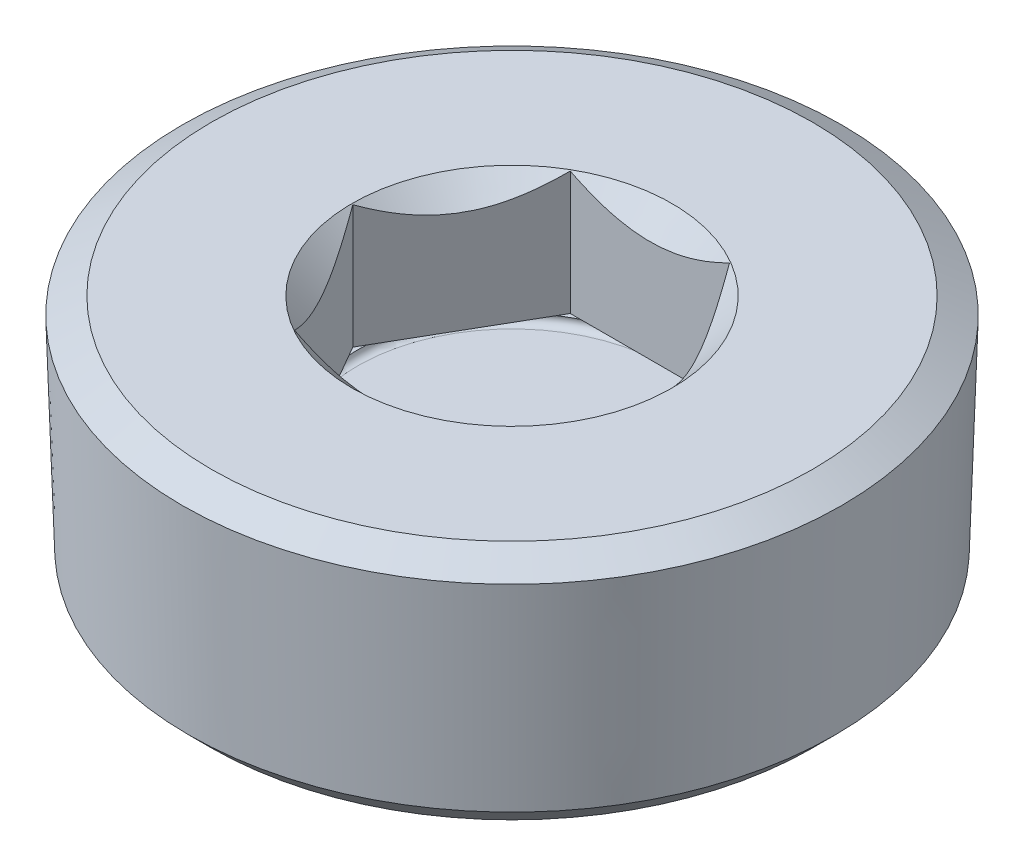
ISO-10303-21;
HEADER;
FILE_DESCRIPTION(('STEP AP214'),'2;1');
FILE_NAME('part.step','',(''),(''),'','','');
FILE_SCHEMA(('AUTOMOTIVE_DESIGN { 1 0 10303 214 1 1 1 1 }'));
ENDSEC;
DATA;
#1=APPLICATION_CONTEXT('core data for automotive mechanical design processes');
#2=APPLICATION_PROTOCOL_DEFINITION('international standard','automotive_design',2000,#1);
#3=PRODUCT_CONTEXT('',#1,'mechanical');
#4=PRODUCT('Part','Part','',(#3));
#5=PRODUCT_RELATED_PRODUCT_CATEGORY('part','',(#4));
#6=PRODUCT_DEFINITION_FORMATION('','',#4);
#7=PRODUCT_DEFINITION_CONTEXT('part definition',#1,'design');
#8=PRODUCT_DEFINITION('design','',#6,#7);
#9=PRODUCT_DEFINITION_SHAPE('','',#8);
#10=(LENGTH_UNIT() NAMED_UNIT(*) SI_UNIT(.MILLI.,.METRE.));
#11=(NAMED_UNIT(*) PLANE_ANGLE_UNIT() SI_UNIT($,.RADIAN.));
#12=(NAMED_UNIT(*) SI_UNIT($,.STERADIAN.) SOLID_ANGLE_UNIT());
#13=UNCERTAINTY_MEASURE_WITH_UNIT(LENGTH_MEASURE(1.E-05),#10,'distance_accuracy_value','');
#14=(GEOMETRIC_REPRESENTATION_CONTEXT(3) GLOBAL_UNCERTAINTY_ASSIGNED_CONTEXT((#13)) GLOBAL_UNIT_ASSIGNED_CONTEXT((#10,
#11,#12)) REPRESENTATION_CONTEXT('',''));
#15=CARTESIAN_POINT('',(0.,0.,0.));
#16=DIRECTION('',(0.,0.,1.));
#17=DIRECTION('',(1.,0.,0.));
#18=AXIS2_PLACEMENT_3D('',#15,#16,#17);
#19=CARTESIAN_POINT('',(0.,0.,0.));
#20=DIRECTION('',(0.,1.,0.));
#21=DIRECTION('',(0.,0.,1.));
#22=AXIS2_PLACEMENT_3D('',#19,#20,#21);
#23=PLANE('',#22);
#24=CARTESIAN_POINT('',(0.,0.,0.));
#25=DIRECTION('',(0.,1.,0.));
#26=DIRECTION('',(0.,0.,1.));
#27=AXIS2_PLACEMENT_3D('',#24,#25,#26);
#28=CIRCLE('',#27,14.732);
#29=CARTESIAN_POINT('',(0.,0.,14.732));
#30=VERTEX_POINT('',#29);
#31=EDGE_CURVE('E177',#30,#30,#28,.T.);
#32=ORIENTED_EDGE('',*,*,#31,.F.);
#33=EDGE_LOOP('',(#32));
#34=FACE_BOUND('',#33,.T.);
#35=CARTESIAN_POINT('',(0.,0.,0.));
#36=DIRECTION('',(0.,1.,0.));
#37=DIRECTION('',(0.,0.,1.));
#38=AXIS2_PLACEMENT_3D('',#35,#36,#37);
#39=CIRCLE('',#38,27.6907105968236);
#40=CARTESIAN_POINT('',(0.,0.,27.6907105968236));
#41=VERTEX_POINT('',#40);
#42=EDGE_CURVE('E12',#41,#41,#39,.T.);
#43=ORIENTED_EDGE('',*,*,#42,.T.);
#44=EDGE_LOOP('',(#43));
#45=FACE_BOUND('',#44,.T.);
#46=ADVANCED_FACE('F33',(#34,#45),#23,.T.);
#47=CARTESIAN_POINT('',(0.,0.,0.));
#48=DIRECTION('',(0.,-1.,0.));
#49=DIRECTION('',(0.,0.,-1.));
#50=AXIS2_PLACEMENT_3D('',#47,#48,#49);
#51=CONICAL_SURFACE('',#50,27.6907105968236,1.0471975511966);
#52=CARTESIAN_POINT('',(0.,-1.54587407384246,0.));
#53=DIRECTION('',(0.,1.,0.));
#54=DIRECTION('',(0.,0.,1.));
#55=AXIS2_PLACEMENT_3D('',#52,#53,#54);
#56=CIRCLE('',#55,30.3682430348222);
#57=CARTESIAN_POINT('',(0.,-1.54587407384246,30.3682430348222));
#58=VERTEX_POINT('',#57);
#59=EDGE_CURVE('E40',#58,#58,#56,.T.);
#60=ORIENTED_EDGE('',*,*,#59,.T.);
#61=EDGE_LOOP('',(#60));
#62=FACE_BOUND('',#61,.T.);
#63=ORIENTED_EDGE('',*,*,#42,.F.);
#64=EDGE_LOOP('',(#63));
#65=FACE_BOUND('',#64,.T.);
#66=ADVANCED_FACE('F191',(#62,#65),#51,.T.);
#67=CARTESIAN_POINT('',(0.,-1.54587407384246,0.));
#68=DIRECTION('',(0.,1.,0.));
#69=DIRECTION('',(0.,0.,1.));
#70=AXIS2_PLACEMENT_3D('',#67,#68,#69);
#71=CONICAL_SURFACE('',#70,30.3682430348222,0.0312064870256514);
#72=CARTESIAN_POINT('',(0.,-20.1275238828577,0.));
#73=DIRECTION('',(0.,1.,0.));
#74=DIRECTION('',(0.,0.,1.));
#75=AXIS2_PLACEMENT_3D('',#72,#73,#74);
#76=CIRCLE('',#75,29.7881867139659);
#77=CARTESIAN_POINT('',(0.,-20.1275238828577,29.7881867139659));
#78=VERTEX_POINT('',#77);
#79=EDGE_CURVE('E186',#78,#78,#76,.T.);
#80=ORIENTED_EDGE('',*,*,#79,.T.);
#81=EDGE_LOOP('',(#80));
#82=FACE_BOUND('',#81,.T.);
#83=ORIENTED_EDGE('',*,*,#59,.F.);
#84=EDGE_LOOP('',(#83));
#85=FACE_BOUND('',#84,.T.);
#86=ADVANCED_FACE('F194',(#82,#85),#71,.T.);
#87=CARTESIAN_POINT('',(0.,-20.1275238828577,0.));
#88=DIRECTION('',(0.,1.,0.));
#89=DIRECTION('',(0.,0.,1.));
#90=AXIS2_PLACEMENT_3D('',#87,#88,#89);
#91=CONICAL_SURFACE('',#90,29.7881867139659,0.785398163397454);
#92=CARTESIAN_POINT('',(0.,-22.225,0.));
#93=DIRECTION('',(0.,1.,0.));
#94=DIRECTION('',(0.,0.,1.));
#95=AXIS2_PLACEMENT_3D('',#92,#93,#94);
#96=CIRCLE('',#95,27.6907105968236);
#97=CARTESIAN_POINT('',(0.,-22.225,27.6907105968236));
#98=VERTEX_POINT('',#97);
#99=EDGE_CURVE('E183',#98,#98,#96,.T.);
#100=ORIENTED_EDGE('',*,*,#99,.T.);
#101=EDGE_LOOP('',(#100));
#102=FACE_BOUND('',#101,.T.);
#103=ORIENTED_EDGE('',*,*,#79,.F.);
#104=EDGE_LOOP('',(#103));
#105=FACE_BOUND('',#104,.T.);
#106=ADVANCED_FACE('F196',(#102,#105),#91,.T.);
#107=CARTESIAN_POINT('',(-27.6907105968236,-22.225,0.));
#108=DIRECTION('',(0.,-1.,0.));
#109=DIRECTION('',(0.,0.,-1.));
#110=AXIS2_PLACEMENT_3D('',#107,#108,#109);
#111=PLANE('',#110);
#112=ORIENTED_EDGE('',*,*,#99,.F.);
#113=EDGE_LOOP('',(#112));
#114=FACE_BOUND('',#113,.T.);
#115=ADVANCED_FACE('F203',(#114),#111,.T.);
#116=CARTESIAN_POINT('',(0.,0.,0.));
#117=DIRECTION('',(0.,1.,0.));
#118=DIRECTION('',(0.,0.,1.));
#119=AXIS2_PLACEMENT_3D('',#116,#117,#118);
#120=CONICAL_SURFACE('',#119,14.732,0.785398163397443);
#121=CARTESIAN_POINT('',(-15.3291894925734,5.17463332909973,12.7));
#122=CARTESIAN_POINT('',(-14.9589479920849,4.88959123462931,12.7));
#123=CARTESIAN_POINT('',(-14.5867146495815,4.60709574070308,12.7));
#124=CARTESIAN_POINT('',(-13.8374490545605,4.04836230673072,12.7));
#125=CARTESIAN_POINT('',(-13.4604156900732,3.77212585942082,12.7));
#126=CARTESIAN_POINT('',(-12.6979798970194,3.22510913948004,12.7));
#127=CARTESIAN_POINT('',(-12.3125353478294,2.95438738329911,12.7));
#128=CARTESIAN_POINT('',(-11.5352366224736,2.42233918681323,12.7));
#129=CARTESIAN_POINT('',(-11.1433828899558,2.16101210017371,12.7));
#130=CARTESIAN_POINT('',(-10.3270006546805,1.63362575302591,12.7));
#131=CARTESIAN_POINT('',(-9.90198012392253,1.36832433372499,12.7));
#132=CARTESIAN_POINT('',(-9.0419558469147,0.854150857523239,12.7));
#133=CARTESIAN_POINT('',(-8.60695043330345,0.605281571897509,12.7));
#134=CARTESIAN_POINT('',(-7.72683347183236,0.129269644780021,12.7));
#135=CARTESIAN_POINT('',(-7.28175668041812,-0.0979367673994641,12.7));
#136=CARTESIAN_POINT('',(-6.3789973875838,-0.525532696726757,12.7));
#137=CARTESIAN_POINT('',(-5.92132096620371,-0.725934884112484,12.7));
#138=CARTESIAN_POINT('',(-5.03853629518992,-1.07443088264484,12.7));
#139=CARTESIAN_POINT('',(-4.61470922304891,-1.22574334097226,12.7));
#140=CARTESIAN_POINT('',(-3.75615169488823,-1.49444779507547,12.7));
#141=CARTESIAN_POINT('',(-3.32142054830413,-1.6118376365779,12.7));
#142=CARTESIAN_POINT('',(-2.66688443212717,-1.75671421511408,12.7));
#143=CARTESIAN_POINT('',(-2.45041353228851,-1.79953502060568,12.7));
#144=CARTESIAN_POINT('',(-2.01568738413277,-1.87481478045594,12.7));
#145=CARTESIAN_POINT('',(-1.79743238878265,-1.90727517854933,12.7));
#146=CARTESIAN_POINT('',(-1.35959203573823,-1.96127985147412,12.7));
#147=CARTESIAN_POINT('',(-1.14000679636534,-1.98282508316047,12.7));
#148=CARTESIAN_POINT('',(-0.700016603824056,-2.0146147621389,12.7));
#149=CARTESIAN_POINT('',(-0.479611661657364,-2.02485936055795,12.7));
#150=CARTESIAN_POINT('',(-0.048288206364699,-2.03365728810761,12.7));
#151=CARTESIAN_POINT('',(0.162620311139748,-2.0327059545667,12.7));
#152=CARTESIAN_POINT('',(0.584151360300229,-2.02031870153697,12.7));
#153=CARTESIAN_POINT('',(0.794773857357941,-2.00888161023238,12.7));
#154=CARTESIAN_POINT('',(1.21519356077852,-1.97571555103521,12.7));
#155=CARTESIAN_POINT('',(1.42499081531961,-1.95398719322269,12.7));
#156=CARTESIAN_POINT('',(1.84332802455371,-1.90060227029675,12.7));
#157=CARTESIAN_POINT('',(2.05186780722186,-1.86894437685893,12.7));
#158=CARTESIAN_POINT('',(2.68244777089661,-1.75846982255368,12.7));
#159=CARTESIAN_POINT('',(3.10194616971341,-1.66476681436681,12.7));
#160=CARTESIAN_POINT('',(3.93162363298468,-1.44337797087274,12.7));
#161=CARTESIAN_POINT('',(4.34180321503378,-1.31569402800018,12.7));
#162=CARTESIAN_POINT('',(5.17500836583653,-1.02397670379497,12.7));
#163=CARTESIAN_POINT('',(5.59745269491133,-0.858298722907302,12.7));
#164=CARTESIAN_POINT('',(6.43147266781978,-0.501341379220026,12.7));
#165=CARTESIAN_POINT('',(6.84304331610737,-0.310050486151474,12.7));
#166=CARTESIAN_POINT('',(7.65726509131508,0.0935964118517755,12.7));
#167=CARTESIAN_POINT('',(8.05988381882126,0.306017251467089,12.7));
#168=CARTESIAN_POINT('',(8.85589628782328,0.747250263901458,12.7));
#169=CARTESIAN_POINT('',(9.24929143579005,0.976059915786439,12.7));
#170=CARTESIAN_POINT('',(10.008839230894,1.43524962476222,12.7));
#171=CARTESIAN_POINT('',(10.37537796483,1.66499441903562,12.7));
#172=CARTESIAN_POINT('',(11.1021578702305,2.13426677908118,12.7));
#173=CARTESIAN_POINT('',(11.4623985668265,2.37379507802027,12.7));
#174=CARTESIAN_POINT('',(12.1745109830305,2.85894094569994,12.7));
#175=CARTESIAN_POINT('',(12.5264266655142,3.10449421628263,12.7));
#176=CARTESIAN_POINT('',(13.2254296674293,3.60218595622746,12.7));
#177=CARTESIAN_POINT('',(13.5725182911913,3.85432259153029,12.7));
#178=CARTESIAN_POINT('',(13.917581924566,4.10915406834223,12.7));
#179=B_SPLINE_CURVE_WITH_KNOTS('',3,(#121,#122,#123,#124,#125,#126,#127,#128,#129,#130,#131,
#132,#133,#134,#135,#136,#137,#138,#139,#140,#141,#142,#143,#144,#145,#146,#147,#148,#149,#150,
#151,#152,#153,#154,#155,#156,#157,#158,#159,#160,#161,#162,#163,#164,#165,#166,#167,#168,#169,
#170,#171,#172,#173,#174,#175,#176,#177,#178),.UNSPECIFIED.,.F.,.F.,(4,2,2,2,2,2,2,2,2,2,2,2,2,
2,2,2,2,2,2,2,2,2,2,2,2,2,2,2,4),(0.,1.40179234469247,2.80391556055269,4.21685329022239,
5.62969362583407,7.13247727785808,8.63551372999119,10.1339793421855,11.6317341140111,
12.9807032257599,14.3297579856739,14.991546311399,15.6532423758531,16.3148804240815,
16.9765096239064,17.608980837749,18.2415227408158,18.8740271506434,19.5066162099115,
20.7942875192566,22.0818871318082,23.4421454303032,24.8030181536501,26.168203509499,
27.5331793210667,28.8307644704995,30.128447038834,31.4157149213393,32.7026279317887),.UNSPECIFIED.);
#180=CARTESIAN_POINT('',(7.33234841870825,-0.0673031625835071,12.7));
#181=VERTEX_POINT('',#180);
#182=CARTESIAN_POINT('',(-7.33234841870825,-0.0673031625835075,12.7));
#183=VERTEX_POINT('',#182);
#184=EDGE_CURVE('E47',#181,#183,#179,.F.);
#185=ORIENTED_EDGE('',*,*,#184,.T.);
#186=CARTESIAN_POINT('',(-7.33223294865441,-0.0671876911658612,12.7002));
#187=CARTESIAN_POINT('',(-7.45829190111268,-0.193227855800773,12.4818594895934));
#188=CARTESIAN_POINT('',(-7.58533809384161,-0.315421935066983,12.2618090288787));
#189=CARTESIAN_POINT('',(-7.84155862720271,-0.550896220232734,11.8180220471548));
#190=CARTESIAN_POINT('',(-7.97073408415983,-0.66417155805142,11.5942835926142));
#191=CARTESIAN_POINT('',(-8.23197607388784,-0.881066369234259,11.1417991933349));
#192=CARTESIAN_POINT('',(-8.364054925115,-0.984626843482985,10.9130319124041));
#193=CARTESIAN_POINT('',(-8.63038195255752,-1.17984271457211,10.4517399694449));
#194=CARTESIAN_POINT('',(-8.76462979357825,-1.27149993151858,10.2192158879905));
#195=CARTESIAN_POINT('',(-9.03313634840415,-1.44000927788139,9.75414889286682));
#196=CARTESIAN_POINT('',(-9.16736206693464,-1.51707050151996,9.52166312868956));
#197=CARTESIAN_POINT('',(-9.43769508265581,-1.65658272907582,9.05343261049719));
#198=CARTESIAN_POINT('',(-9.57380217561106,-1.71903530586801,8.81768821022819));
#199=CARTESIAN_POINT('',(-9.84731577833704,-1.82775795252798,8.34394875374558));
#200=CARTESIAN_POINT('',(-9.98471863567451,-1.874064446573,8.10596002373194));
#201=CARTESIAN_POINT('',(-10.2606778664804,-1.94947741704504,7.62798461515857));
#202=CARTESIAN_POINT('',(-10.3992340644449,-1.97858646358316,7.38799824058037));
#203=CARTESIAN_POINT('',(-10.7368852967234,-2.02739428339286,6.80316915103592));
#204=CARTESIAN_POINT('',(-10.9363452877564,-2.03763638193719,6.45769431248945));
#205=CARTESIAN_POINT('',(-11.3349045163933,-2.02044398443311,5.7673694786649));
#206=CARTESIAN_POINT('',(-11.5340036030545,-1.99299628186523,5.4225197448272));
#207=CARTESIAN_POINT('',(-11.9303249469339,-1.90204439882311,4.7360710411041));
#208=CARTESIAN_POINT('',(-12.1275448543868,-1.83849990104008,4.39447614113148));
#209=CARTESIAN_POINT('',(-12.5185948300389,-1.67880849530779,3.7171577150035));
#210=CARTESIAN_POINT('',(-12.7124251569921,-1.58266408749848,3.38143374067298));
#211=CARTESIAN_POINT('',(-13.0564965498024,-1.38487297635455,2.78548460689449));
#212=CARTESIAN_POINT('',(-13.207499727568,-1.28842963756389,2.52393943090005));
#213=CARTESIAN_POINT('',(-13.5067956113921,-1.08000258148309,2.00554375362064));
#214=CARTESIAN_POINT('',(-13.6550882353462,-0.968018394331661,1.74869339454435));
#215=CARTESIAN_POINT('',(-13.9484959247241,-0.731019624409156,1.24049636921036));
#216=CARTESIAN_POINT('',(-14.0936193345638,-0.606046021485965,0.989135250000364));
#217=CARTESIAN_POINT('',(-14.3811790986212,-0.34470890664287,0.491067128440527));
#218=CARTESIAN_POINT('',(-14.5236170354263,-0.208352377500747,0.2443573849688));
#219=CARTESIAN_POINT('',(-14.6648123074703,-0.0671876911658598,-0.00019999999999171));
#220=B_SPLINE_CURVE_WITH_KNOTS('',3,(#186,#187,#188,#189,#190,#191,#192,#193,#194,#195,#196,
#197,#198,#199,#200,#201,#202,#203,#204,#205,#206,#207,#208,#209,#210,#211,#212,#213,#214,#215,
#216,#217,#218,#219),.UNSPECIFIED.,.F.,.F.,(4,2,2,2,2,2,2,2,2,2,2,2,2,2,2,2,4),(0.,
0.845639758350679,1.69173793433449,2.54268053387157,3.39349286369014,4.23100113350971,
5.06841918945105,5.90393569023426,6.73932729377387,7.9346157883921,9.13032321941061,
10.3273687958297,11.5243225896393,12.4749718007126,13.4256497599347,14.3734146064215,
15.3206022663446),.UNSPECIFIED.);
#221=CARTESIAN_POINT('',(-14.6646968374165,-0.0673031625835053,0.));
#222=VERTEX_POINT('',#221);
#223=EDGE_CURVE('E140',#183,#222,#220,.T.);
#224=ORIENTED_EDGE('',*,*,#223,.T.);
#225=CARTESIAN_POINT('',(-14.6648123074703,-0.0671876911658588,0.00020000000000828));
#226=CARTESIAN_POINT('',(-14.5387533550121,-0.193227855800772,-0.218140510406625));
#227=CARTESIAN_POINT('',(-14.4117071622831,-0.315421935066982,-0.438190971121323));
#228=CARTESIAN_POINT('',(-14.155486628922,-0.550896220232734,-0.881977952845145));
#229=CARTESIAN_POINT('',(-14.0263111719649,-0.66417155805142,-1.10571640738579));
#230=CARTESIAN_POINT('',(-13.7650691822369,-0.881066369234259,-1.5582008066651));
#231=CARTESIAN_POINT('',(-13.6329903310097,-0.984626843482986,-1.78696808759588));
#232=CARTESIAN_POINT('',(-13.3666633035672,-1.17984271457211,-2.24826003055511));
#233=CARTESIAN_POINT('',(-13.2324154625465,-1.27149993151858,-2.48078411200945));
#234=CARTESIAN_POINT('',(-12.9639089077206,-1.44000927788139,-2.94585110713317));
#235=CARTESIAN_POINT('',(-12.8296831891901,-1.51707050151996,-3.17833687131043));
#236=CARTESIAN_POINT('',(-12.5593501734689,-1.65658272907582,-3.64656738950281));
#237=CARTESIAN_POINT('',(-12.4232430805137,-1.71903530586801,-3.8823117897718));
#238=CARTESIAN_POINT('',(-12.1497294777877,-1.82775795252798,-4.35605124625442));
#239=CARTESIAN_POINT('',(-12.0123266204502,-1.87406444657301,-4.59403997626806));
#240=CARTESIAN_POINT('',(-11.7363673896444,-1.94947741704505,-5.07201538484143));
#241=CARTESIAN_POINT('',(-11.5978111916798,-1.97858646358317,-5.31200175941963));
#242=CARTESIAN_POINT('',(-11.2601599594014,-2.02739428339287,-5.89683084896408));
#243=CARTESIAN_POINT('',(-11.0606999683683,-2.03763638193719,-6.24230568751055));
#244=CARTESIAN_POINT('',(-10.6621407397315,-2.02044398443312,-6.9326305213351));
#245=CARTESIAN_POINT('',(-10.4630416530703,-1.99299628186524,-7.2774802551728));
#246=CARTESIAN_POINT('',(-10.0667203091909,-1.90204439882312,-7.9639289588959));
#247=CARTESIAN_POINT('',(-9.86950040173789,-1.83849990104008,-8.30552385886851));
#248=CARTESIAN_POINT('',(-9.47845042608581,-1.67880849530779,-8.9828422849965));
#249=CARTESIAN_POINT('',(-9.28462009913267,-1.58266408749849,-9.31856625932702));
#250=CARTESIAN_POINT('',(-8.94054870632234,-1.38487297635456,-9.91451539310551));
#251=CARTESIAN_POINT('',(-8.7895455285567,-1.2884296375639,-10.1760605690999));
#252=CARTESIAN_POINT('',(-8.49024964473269,-1.0800025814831,-10.6944562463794));
#253=CARTESIAN_POINT('',(-8.34195702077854,-0.968018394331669,-10.9513066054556));
#254=CARTESIAN_POINT('',(-8.0485493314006,-0.731019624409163,-11.4595036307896));
#255=CARTESIAN_POINT('',(-7.9034259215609,-0.606046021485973,-11.7108647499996));
#256=CARTESIAN_POINT('',(-7.61586615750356,-0.344708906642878,-12.2089328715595));
#257=CARTESIAN_POINT('',(-7.47342822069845,-0.208352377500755,-12.4556426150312));
#258=CARTESIAN_POINT('',(-7.33223294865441,-0.0671876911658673,-12.7002));
#259=B_SPLINE_CURVE_WITH_KNOTS('',3,(#225,#226,#227,#228,#229,#230,#231,#232,#233,#234,#235,
#236,#237,#238,#239,#240,#241,#242,#243,#244,#245,#246,#247,#248,#249,#250,#251,#252,#253,#254,
#255,#256,#257,#258),.UNSPECIFIED.,.F.,.F.,(4,2,2,2,2,2,2,2,2,2,2,2,2,2,2,2,4),(0.,
0.84563975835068,1.6917379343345,2.54268053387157,3.39349286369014,4.23100113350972,
5.06841918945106,5.90393569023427,6.73932729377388,7.93461578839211,9.13032321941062,
10.3273687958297,11.5243225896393,12.4749718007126,13.4256497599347,14.3734146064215,
15.3206022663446),.UNSPECIFIED.);
#260=CARTESIAN_POINT('',(-7.33234841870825,-0.0673031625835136,-12.7));
#261=VERTEX_POINT('',#260);
#262=EDGE_CURVE('E262',#222,#261,#259,.T.);
#263=ORIENTED_EDGE('',*,*,#262,.T.);
#264=CARTESIAN_POINT('',(-15.3291894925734,5.17463332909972,-12.7));
#265=CARTESIAN_POINT('',(-14.9589479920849,4.8895912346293,-12.7));
#266=CARTESIAN_POINT('',(-14.5867146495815,4.60709574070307,-12.7));
#267=CARTESIAN_POINT('',(-13.8374490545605,4.04836230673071,-12.7));
#268=CARTESIAN_POINT('',(-13.4604156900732,3.77212585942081,-12.7));
#269=CARTESIAN_POINT('',(-12.6979798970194,3.22510913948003,-12.7));
#270=CARTESIAN_POINT('',(-12.3125353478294,2.95438738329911,-12.7));
#271=CARTESIAN_POINT('',(-11.5352366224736,2.42233918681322,-12.7));
#272=CARTESIAN_POINT('',(-11.1433828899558,2.1610121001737,-12.7));
#273=CARTESIAN_POINT('',(-10.3270006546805,1.6336257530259,-12.7));
#274=CARTESIAN_POINT('',(-9.90198012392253,1.36832433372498,-12.7));
#275=CARTESIAN_POINT('',(-9.0419558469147,0.854150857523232,-12.7));
#276=CARTESIAN_POINT('',(-8.60695043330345,0.6052815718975,-12.7));
#277=CARTESIAN_POINT('',(-7.72683347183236,0.129269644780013,-12.7));
#278=CARTESIAN_POINT('',(-7.28175668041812,-0.0979367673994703,-12.7));
#279=CARTESIAN_POINT('',(-6.3789973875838,-0.525532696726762,-12.7));
#280=CARTESIAN_POINT('',(-5.92132096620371,-0.725934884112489,-12.7));
#281=CARTESIAN_POINT('',(-5.03853629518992,-1.07443088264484,-12.7));
#282=CARTESIAN_POINT('',(-4.61470922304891,-1.22574334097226,-12.7));
#283=CARTESIAN_POINT('',(-3.75615169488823,-1.49444779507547,-12.7));
#284=CARTESIAN_POINT('',(-3.32142054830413,-1.6118376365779,-12.7));
#285=CARTESIAN_POINT('',(-2.66688443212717,-1.75671421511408,-12.7));
#286=CARTESIAN_POINT('',(-2.45041353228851,-1.79953502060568,-12.7));
#287=CARTESIAN_POINT('',(-2.01568738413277,-1.87481478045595,-12.7));
#288=CARTESIAN_POINT('',(-1.79743238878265,-1.90727517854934,-12.7));
#289=CARTESIAN_POINT('',(-1.35959203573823,-1.96127985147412,-12.7));
#290=CARTESIAN_POINT('',(-1.14000679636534,-1.98282508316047,-12.7));
#291=CARTESIAN_POINT('',(-0.70001660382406,-2.01461476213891,-12.7));
#292=CARTESIAN_POINT('',(-0.479611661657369,-2.02485936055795,-12.7));
#293=CARTESIAN_POINT('',(-0.0482882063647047,-2.03365728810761,-12.7));
#294=CARTESIAN_POINT('',(0.162620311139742,-2.03270595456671,-12.7));
#295=CARTESIAN_POINT('',(0.584151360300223,-2.02031870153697,-12.7));
#296=CARTESIAN_POINT('',(0.794773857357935,-2.00888161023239,-12.7));
#297=CARTESIAN_POINT('',(1.21519356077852,-1.97571555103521,-12.7));
#298=CARTESIAN_POINT('',(1.4249908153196,-1.95398719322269,-12.7));
#299=CARTESIAN_POINT('',(1.8433280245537,-1.90060227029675,-12.7));
#300=CARTESIAN_POINT('',(2.05186780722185,-1.86894437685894,-12.7));
#301=CARTESIAN_POINT('',(2.6824477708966,-1.75846982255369,-12.7));
#302=CARTESIAN_POINT('',(3.1019461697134,-1.66476681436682,-12.7));
#303=CARTESIAN_POINT('',(3.93162363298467,-1.44337797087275,-12.7));
#304=CARTESIAN_POINT('',(4.34180321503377,-1.31569402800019,-12.7));
#305=CARTESIAN_POINT('',(5.17500836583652,-1.02397670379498,-12.7));
#306=CARTESIAN_POINT('',(5.59745269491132,-0.858298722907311,-12.7));
#307=CARTESIAN_POINT('',(6.43147266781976,-0.501341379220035,-12.7));
#308=CARTESIAN_POINT('',(6.84304331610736,-0.310050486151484,-12.7));
#309=CARTESIAN_POINT('',(7.65726509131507,0.0935964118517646,-12.7));
#310=CARTESIAN_POINT('',(8.05988381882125,0.306017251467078,-12.7));
#311=CARTESIAN_POINT('',(8.85589628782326,0.747250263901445,-12.7));
#312=CARTESIAN_POINT('',(9.24929143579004,0.976059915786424,-12.7));
#313=CARTESIAN_POINT('',(10.008839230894,1.43524962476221,-12.7));
#314=CARTESIAN_POINT('',(10.3753779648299,1.66499441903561,-12.7));
#315=CARTESIAN_POINT('',(11.1021578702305,2.13426677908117,-12.7));
#316=CARTESIAN_POINT('',(11.4623985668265,2.37379507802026,-12.7));
#317=CARTESIAN_POINT('',(12.1745109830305,2.85894094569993,-12.7));
#318=CARTESIAN_POINT('',(12.5264266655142,3.10449421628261,-12.7));
#319=CARTESIAN_POINT('',(13.2254296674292,3.60218595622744,-12.7));
#320=CARTESIAN_POINT('',(13.5725182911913,3.85432259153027,-12.7));
#321=CARTESIAN_POINT('',(13.917581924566,4.10915406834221,-12.7));
#322=B_SPLINE_CURVE_WITH_KNOTS('',3,(#264,#265,#266,#267,#268,#269,#270,#271,#272,#273,#274,
#275,#276,#277,#278,#279,#280,#281,#282,#283,#284,#285,#286,#287,#288,#289,#290,#291,#292,#293,
#294,#295,#296,#297,#298,#299,#300,#301,#302,#303,#304,#305,#306,#307,#308,#309,#310,#311,#312,
#313,#314,#315,#316,#317,#318,#319,#320,#321),.UNSPECIFIED.,.F.,.F.,(4,2,2,2,2,2,2,2,2,2,2,2,2,
2,2,2,2,2,2,2,2,2,2,2,2,2,2,2,4),(0.,1.40179234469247,2.80391556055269,4.21685329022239,
5.62969362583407,7.13247727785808,8.63551372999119,10.1339793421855,11.6317341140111,
12.9807032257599,14.3297579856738,14.991546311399,15.6532423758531,16.3148804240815,
16.9765096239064,17.608980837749,18.2415227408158,18.8740271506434,19.5066162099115,
20.7942875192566,22.0818871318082,23.4421454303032,24.80301815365,26.168203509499,
27.5331793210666,28.8307644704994,30.128447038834,31.4157149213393,32.7026279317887),.UNSPECIFIED.);
#323=CARTESIAN_POINT('',(7.33234841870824,-0.0673031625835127,-12.7));
#324=VERTEX_POINT('',#323);
#325=EDGE_CURVE('E255',#261,#324,#322,.T.);
#326=ORIENTED_EDGE('',*,*,#325,.T.);
#327=CARTESIAN_POINT('',(7.33223294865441,-0.0671876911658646,-12.7002));
#328=CARTESIAN_POINT('',(7.45829190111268,-0.193227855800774,-12.4818594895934));
#329=CARTESIAN_POINT('',(7.58533809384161,-0.315421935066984,-12.2618090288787));
#330=CARTESIAN_POINT('',(7.84155862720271,-0.550896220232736,-11.8180220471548));
#331=CARTESIAN_POINT('',(7.97073408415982,-0.664171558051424,-11.5942835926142));
#332=CARTESIAN_POINT('',(8.23197607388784,-0.881066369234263,-11.1417991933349));
#333=CARTESIAN_POINT('',(8.364054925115,-0.984626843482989,-10.9130319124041));
#334=CARTESIAN_POINT('',(8.63038195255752,-1.17984271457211,-10.4517399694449));
#335=CARTESIAN_POINT('',(8.76462979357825,-1.27149993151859,-10.2192158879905));
#336=CARTESIAN_POINT('',(9.03313634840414,-1.44000927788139,-9.75414889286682));
#337=CARTESIAN_POINT('',(9.16736206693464,-1.51707050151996,-9.52166312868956));
#338=CARTESIAN_POINT('',(9.43769508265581,-1.65658272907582,-9.05343261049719));
#339=CARTESIAN_POINT('',(9.57380217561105,-1.71903530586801,-8.81768821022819));
#340=CARTESIAN_POINT('',(9.84731577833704,-1.82775795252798,-8.34394875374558));
#341=CARTESIAN_POINT('',(9.98471863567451,-1.874064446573,-8.10596002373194));
#342=CARTESIAN_POINT('',(10.2606778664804,-1.94947741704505,-7.62798461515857));
#343=CARTESIAN_POINT('',(10.3992340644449,-1.97858646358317,-7.38799824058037));
#344=CARTESIAN_POINT('',(10.7368852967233,-2.02739428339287,-6.80316915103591));
#345=CARTESIAN_POINT('',(10.9363452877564,-2.03763638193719,-6.45769431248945));
#346=CARTESIAN_POINT('',(11.3349045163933,-2.02044398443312,-5.7673694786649));
#347=CARTESIAN_POINT('',(11.5340036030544,-1.99299628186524,-5.4225197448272));
#348=CARTESIAN_POINT('',(11.9303249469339,-1.90204439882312,-4.7360710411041));
#349=CARTESIAN_POINT('',(12.1275448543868,-1.83849990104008,-4.39447614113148));
#350=CARTESIAN_POINT('',(12.5185948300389,-1.67880849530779,-3.7171577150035));
#351=CARTESIAN_POINT('',(12.7124251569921,-1.58266408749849,-3.38143374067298));
#352=CARTESIAN_POINT('',(13.0564965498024,-1.38487297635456,-2.78548460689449));
#353=CARTESIAN_POINT('',(13.207499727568,-1.2884296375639,-2.52393943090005));
#354=CARTESIAN_POINT('',(13.506795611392,-1.0800025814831,-2.00554375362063));
#355=CARTESIAN_POINT('',(13.6550882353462,-0.968018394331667,-1.74869339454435));
#356=CARTESIAN_POINT('',(13.9484959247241,-0.73101962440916,-1.24049636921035));
#357=CARTESIAN_POINT('',(14.0936193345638,-0.60604602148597,-0.989135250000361));
#358=CARTESIAN_POINT('',(14.3811790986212,-0.344708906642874,-0.491067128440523));
#359=CARTESIAN_POINT('',(14.5236170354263,-0.208352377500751,-0.244357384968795));
#360=CARTESIAN_POINT('',(14.6648123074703,-0.0671876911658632,0.000199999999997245));
#361=B_SPLINE_CURVE_WITH_KNOTS('',3,(#327,#328,#329,#330,#331,#332,#333,#334,#335,#336,#337,
#338,#339,#340,#341,#342,#343,#344,#345,#346,#347,#348,#349,#350,#351,#352,#353,#354,#355,#356,
#357,#358,#359,#360),.UNSPECIFIED.,.F.,.F.,(4,2,2,2,2,2,2,2,2,2,2,2,2,2,2,2,4),(0.,
0.845639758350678,1.69173793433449,2.54268053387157,3.39349286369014,4.23100113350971,
5.06841918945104,5.90393569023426,6.73932729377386,7.93461578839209,9.1303232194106,
10.3273687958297,11.5243225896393,12.4749718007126,13.4256497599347,14.3734146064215,
15.3206022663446),.UNSPECIFIED.);
#362=CARTESIAN_POINT('',(14.6646968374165,-0.0673031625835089,0.));
#363=VERTEX_POINT('',#362);
#364=EDGE_CURVE('E248',#324,#363,#361,.T.);
#365=ORIENTED_EDGE('',*,*,#364,.T.);
#366=CARTESIAN_POINT('',(14.6648123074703,-0.0671876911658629,-0.000200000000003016));
#367=CARTESIAN_POINT('',(14.5387533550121,-0.193227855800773,0.21814051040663));
#368=CARTESIAN_POINT('',(14.4117071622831,-0.315421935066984,0.438190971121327));
#369=CARTESIAN_POINT('',(14.155486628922,-0.550896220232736,0.88197795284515));
#370=CARTESIAN_POINT('',(14.0263111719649,-0.664171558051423,1.1057164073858));
#371=CARTESIAN_POINT('',(13.7650691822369,-0.881066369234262,1.55820080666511));
#372=CARTESIAN_POINT('',(13.6329903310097,-0.984626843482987,1.78696808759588));
#373=CARTESIAN_POINT('',(13.3666633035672,-1.17984271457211,2.24826003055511));
#374=CARTESIAN_POINT('',(13.2324154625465,-1.27149993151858,2.48078411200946));
#375=CARTESIAN_POINT('',(12.9639089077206,-1.44000927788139,2.94585110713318));
#376=CARTESIAN_POINT('',(12.8296831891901,-1.51707050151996,3.17833687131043));
#377=CARTESIAN_POINT('',(12.5593501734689,-1.65658272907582,3.64656738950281));
#378=CARTESIAN_POINT('',(12.4232430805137,-1.71903530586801,3.8823117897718));
#379=CARTESIAN_POINT('',(12.1497294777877,-1.82775795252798,4.35605124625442));
#380=CARTESIAN_POINT('',(12.0123266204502,-1.874064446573,4.59403997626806));
#381=CARTESIAN_POINT('',(11.7363673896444,-1.94947741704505,5.07201538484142));
#382=CARTESIAN_POINT('',(11.5978111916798,-1.97858646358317,5.31200175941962));
#383=CARTESIAN_POINT('',(11.2601599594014,-2.02739428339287,5.89683084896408));
#384=CARTESIAN_POINT('',(11.0606999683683,-2.03763638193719,6.24230568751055));
#385=CARTESIAN_POINT('',(10.6621407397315,-2.02044398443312,6.93263052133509));
#386=CARTESIAN_POINT('',(10.4630416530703,-1.99299628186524,7.27748025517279));
#387=CARTESIAN_POINT('',(10.0667203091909,-1.90204439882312,7.9639289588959));
#388=CARTESIAN_POINT('',(9.8695004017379,-1.83849990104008,8.30552385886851));
#389=CARTESIAN_POINT('',(9.47845042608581,-1.67880849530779,8.9828422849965));
#390=CARTESIAN_POINT('',(9.28462009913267,-1.58266408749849,9.31856625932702));
#391=CARTESIAN_POINT('',(8.94054870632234,-1.38487297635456,9.9145153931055));
#392=CARTESIAN_POINT('',(8.7895455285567,-1.2884296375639,10.1760605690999));
#393=CARTESIAN_POINT('',(8.49024964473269,-1.0800025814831,10.6944562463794));
#394=CARTESIAN_POINT('',(8.34195702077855,-0.968018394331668,10.9513066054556));
#395=CARTESIAN_POINT('',(8.0485493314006,-0.73101962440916,11.4595036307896));
#396=CARTESIAN_POINT('',(7.9034259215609,-0.606046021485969,11.7108647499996));
#397=CARTESIAN_POINT('',(7.61586615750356,-0.344708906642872,12.2089328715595));
#398=CARTESIAN_POINT('',(7.47342822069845,-0.208352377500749,12.4556426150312));
#399=CARTESIAN_POINT('',(7.33223294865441,-0.0671876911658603,12.7002));
#400=B_SPLINE_CURVE_WITH_KNOTS('',3,(#366,#367,#368,#369,#370,#371,#372,#373,#374,#375,#376,
#377,#378,#379,#380,#381,#382,#383,#384,#385,#386,#387,#388,#389,#390,#391,#392,#393,#394,#395,
#396,#397,#398,#399),.UNSPECIFIED.,.F.,.F.,(4,2,2,2,2,2,2,2,2,2,2,2,2,2,2,2,4),(0.,
0.845639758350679,1.69173793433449,2.54268053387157,3.39349286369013,4.23100113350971,
5.06841918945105,5.90393569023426,6.73932729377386,7.93461578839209,9.1303232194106,
10.3273687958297,11.5243225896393,12.4749718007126,13.4256497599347,14.3734146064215,
15.3206022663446),.UNSPECIFIED.);
#401=EDGE_CURVE('E240',#363,#181,#400,.T.);
#402=ORIENTED_EDGE('',*,*,#401,.T.);
#403=EDGE_LOOP('',(#185,#224,#263,#326,#365,#402));
#404=FACE_BOUND('',#403,.T.);
#405=ORIENTED_EDGE('',*,*,#31,.T.);
#406=EDGE_LOOP('',(#405));
#407=FACE_BOUND('',#406,.T.);
#408=ADVANCED_FACE('F214',(#404,#407),#120,.F.);
#409=CARTESIAN_POINT('',(-14.6646968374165,-11.43,0.));
#410=DIRECTION('',(-0.866025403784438,0.,0.5));
#411=DIRECTION('',(0.5,0.,0.866025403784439));
#412=AXIS2_PLACEMENT_3D('',#409,#410,#411);
#413=PLANE('',#412);
#414=DIRECTION('',(0.,1.,0.));
#415=VECTOR('',#414,1.);
#416=CARTESIAN_POINT('',(-7.33234841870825,-11.43,12.7));
#417=LINE('',#416,#415);
#418=CARTESIAN_POINT('',(-7.33234841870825,-11.43,12.7));
#419=VERTEX_POINT('',#418);
#420=EDGE_CURVE('E137',#419,#183,#417,.T.);
#421=ORIENTED_EDGE('',*,*,#420,.F.);
#422=DIRECTION('',(0.5,0.,0.866025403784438));
#423=VECTOR('',#422,1.);
#424=CARTESIAN_POINT('',(-14.6646968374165,-11.43,0.));
#425=LINE('',#424,#423);
#426=CARTESIAN_POINT('',(-7.79570449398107,-11.43,11.8974437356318));
#427=VERTEX_POINT('',#426);
#428=EDGE_CURVE('E123',#427,#419,#425,.T.);
#429=ORIENTED_EDGE('',*,*,#428,.F.);
#430=CARTESIAN_POINT('',(-14.2013407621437,-11.43,0.802556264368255));
#431=VERTEX_POINT('',#430);
#432=EDGE_CURVE('E133',#431,#427,#425,.T.);
#433=ORIENTED_EDGE('',*,*,#432,.F.);
#434=CARTESIAN_POINT('',(-14.6646968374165,-11.43,0.));
#435=VERTEX_POINT('',#434);
#436=EDGE_CURVE('E135',#435,#431,#425,.T.);
#437=ORIENTED_EDGE('',*,*,#436,.F.);
#438=DIRECTION('',(0.,1.,0.));
#439=VECTOR('',#438,1.);
#440=CARTESIAN_POINT('',(-14.6646968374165,-11.43,0.));
#441=LINE('',#440,#439);
#442=EDGE_CURVE('E309',#435,#222,#441,.T.);
#443=ORIENTED_EDGE('',*,*,#442,.T.);
#444=ORIENTED_EDGE('',*,*,#223,.F.);
#445=EDGE_LOOP('',(#421,#429,#433,#437,#443,#444));
#446=FACE_BOUND('',#445,.T.);
#447=ADVANCED_FACE('F138',(#446),#413,.F.);
#448=CARTESIAN_POINT('',(-7.33234841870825,-11.43,-12.7));
#449=DIRECTION('',(-0.866025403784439,0.,-0.5));
#450=DIRECTION('',(-0.5,0.,0.866025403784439));
#451=AXIS2_PLACEMENT_3D('',#448,#449,#450);
#452=PLANE('',#451);
#453=ORIENTED_EDGE('',*,*,#442,.F.);
#454=DIRECTION('',(-0.5,0.,0.866025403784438));
#455=VECTOR('',#454,1.);
#456=CARTESIAN_POINT('',(-7.33234841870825,-11.43,-12.7));
#457=LINE('',#456,#455);
#458=CARTESIAN_POINT('',(-14.2013407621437,-11.43,-0.802556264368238));
#459=VERTEX_POINT('',#458);
#460=EDGE_CURVE('E349',#459,#435,#457,.T.);
#461=ORIENTED_EDGE('',*,*,#460,.F.);
#462=CARTESIAN_POINT('',(-7.79570449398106,-11.43,-11.8974437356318));
#463=VERTEX_POINT('',#462);
#464=EDGE_CURVE('E347',#463,#459,#457,.T.);
#465=ORIENTED_EDGE('',*,*,#464,.F.);
#466=CARTESIAN_POINT('',(-7.33234841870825,-11.43,-12.7));
#467=VERTEX_POINT('',#466);
#468=EDGE_CURVE('E143',#467,#463,#457,.T.);
#469=ORIENTED_EDGE('',*,*,#468,.F.);
#470=DIRECTION('',(0.,1.,0.));
#471=VECTOR('',#470,1.);
#472=CARTESIAN_POINT('',(-7.33234841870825,-11.43,-12.7));
#473=LINE('',#472,#471);
#474=EDGE_CURVE('E312',#467,#261,#473,.T.);
#475=ORIENTED_EDGE('',*,*,#474,.T.);
#476=ORIENTED_EDGE('',*,*,#262,.F.);
#477=EDGE_LOOP('',(#453,#461,#465,#469,#475,#476));
#478=FACE_BOUND('',#477,.T.);
#479=ADVANCED_FACE('F221',(#478),#452,.F.);
#480=CARTESIAN_POINT('',(7.33234841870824,-11.43,-12.7));
#481=DIRECTION('',(0.,0.,-1.));
#482=DIRECTION('',(-1.,0.,0.));
#483=AXIS2_PLACEMENT_3D('',#480,#481,#482);
#484=PLANE('',#483);
#485=ORIENTED_EDGE('',*,*,#474,.F.);
#486=DIRECTION('',(-1.,0.,0.));
#487=VECTOR('',#486,1.);
#488=CARTESIAN_POINT('',(7.33234841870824,-11.43,-12.7));
#489=LINE('',#488,#487);
#490=CARTESIAN_POINT('',(-6.4056362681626,-11.43,-12.7));
#491=VERTEX_POINT('',#490);
#492=EDGE_CURVE('E353',#491,#467,#489,.T.);
#493=ORIENTED_EDGE('',*,*,#492,.F.);
#494=CARTESIAN_POINT('',(6.4056362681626,-11.43,-12.7));
#495=VERTEX_POINT('',#494);
#496=EDGE_CURVE('E352',#495,#491,#489,.T.);
#497=ORIENTED_EDGE('',*,*,#496,.F.);
#498=CARTESIAN_POINT('',(7.33234841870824,-11.43,-12.7));
#499=VERTEX_POINT('',#498);
#500=EDGE_CURVE('E350',#499,#495,#489,.T.);
#501=ORIENTED_EDGE('',*,*,#500,.F.);
#502=DIRECTION('',(0.,1.,0.));
#503=VECTOR('',#502,1.);
#504=CARTESIAN_POINT('',(7.33234841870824,-11.43,-12.7));
#505=LINE('',#504,#503);
#506=EDGE_CURVE('E314',#499,#324,#505,.T.);
#507=ORIENTED_EDGE('',*,*,#506,.T.);
#508=ORIENTED_EDGE('',*,*,#325,.F.);
#509=EDGE_LOOP('',(#485,#493,#497,#501,#507,#508));
#510=FACE_BOUND('',#509,.T.);
#511=ADVANCED_FACE('F275',(#510),#484,.F.);
#512=CARTESIAN_POINT('',(14.6646968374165,-11.43,0.));
#513=DIRECTION('',(0.866025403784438,0.,-0.5));
#514=DIRECTION('',(-0.5,0.,-0.866025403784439));
#515=AXIS2_PLACEMENT_3D('',#512,#513,#514);
#516=PLANE('',#515);
#517=ORIENTED_EDGE('',*,*,#506,.F.);
#518=DIRECTION('',(-0.5,0.,-0.866025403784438));
#519=VECTOR('',#518,1.);
#520=CARTESIAN_POINT('',(14.6646968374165,-11.43,0.));
#521=LINE('',#520,#519);
#522=CARTESIAN_POINT('',(7.79570449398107,-11.43,-11.8974437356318));
#523=VERTEX_POINT('',#522);
#524=EDGE_CURVE('E330',#523,#499,#521,.T.);
#525=ORIENTED_EDGE('',*,*,#524,.F.);
#526=CARTESIAN_POINT('',(14.2013407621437,-11.43,-0.802556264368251));
#527=VERTEX_POINT('',#526);
#528=EDGE_CURVE('E362',#527,#523,#521,.T.);
#529=ORIENTED_EDGE('',*,*,#528,.F.);
#530=CARTESIAN_POINT('',(14.6646968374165,-11.43,0.));
#531=VERTEX_POINT('',#530);
#532=EDGE_CURVE('E358',#531,#527,#521,.T.);
#533=ORIENTED_EDGE('',*,*,#532,.F.);
#534=DIRECTION('',(0.,1.,0.));
#535=VECTOR('',#534,1.);
#536=CARTESIAN_POINT('',(14.6646968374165,-11.43,0.));
#537=LINE('',#536,#535);
#538=EDGE_CURVE('E321',#531,#363,#537,.T.);
#539=ORIENTED_EDGE('',*,*,#538,.T.);
#540=ORIENTED_EDGE('',*,*,#364,.F.);
#541=EDGE_LOOP('',(#517,#525,#529,#533,#539,#540));
#542=FACE_BOUND('',#541,.T.);
#543=ADVANCED_FACE('F279',(#542),#516,.F.);
#544=CARTESIAN_POINT('',(7.33234841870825,-11.43,12.7));
#545=DIRECTION('',(0.866025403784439,0.,0.5));
#546=DIRECTION('',(0.5,0.,-0.866025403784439));
#547=AXIS2_PLACEMENT_3D('',#544,#545,#546);
#548=PLANE('',#547);
#549=ORIENTED_EDGE('',*,*,#538,.F.);
#550=DIRECTION('',(0.5,0.,-0.866025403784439));
#551=VECTOR('',#550,1.);
#552=CARTESIAN_POINT('',(7.33234841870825,-11.43,12.7));
#553=LINE('',#552,#551);
#554=CARTESIAN_POINT('',(14.2013407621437,-11.43,0.802556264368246));
#555=VERTEX_POINT('',#554);
#556=EDGE_CURVE('E150',#555,#531,#553,.T.);
#557=ORIENTED_EDGE('',*,*,#556,.F.);
#558=CARTESIAN_POINT('',(7.79570449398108,-11.43,11.8974437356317));
#559=VERTEX_POINT('',#558);
#560=EDGE_CURVE('E55',#559,#555,#553,.T.);
#561=ORIENTED_EDGE('',*,*,#560,.F.);
#562=CARTESIAN_POINT('',(7.33234841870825,-11.43,12.7));
#563=VERTEX_POINT('',#562);
#564=EDGE_CURVE('E154',#563,#559,#553,.T.);
#565=ORIENTED_EDGE('',*,*,#564,.F.);
#566=DIRECTION('',(0.,1.,0.));
#567=VECTOR('',#566,1.);
#568=CARTESIAN_POINT('',(7.33234841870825,-11.43,12.7));
#569=LINE('',#568,#567);
#570=EDGE_CURVE('E142',#563,#181,#569,.T.);
#571=ORIENTED_EDGE('',*,*,#570,.T.);
#572=ORIENTED_EDGE('',*,*,#401,.F.);
#573=EDGE_LOOP('',(#549,#557,#561,#565,#571,#572));
#574=FACE_BOUND('',#573,.T.);
#575=ADVANCED_FACE('F283',(#574),#548,.F.);
#576=CARTESIAN_POINT('',(-7.33234841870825,-11.43,12.7));
#577=DIRECTION('',(0.,0.,1.));
#578=DIRECTION('',(1.,0.,0.));
#579=AXIS2_PLACEMENT_3D('',#576,#577,#578);
#580=PLANE('',#579);
#581=ORIENTED_EDGE('',*,*,#570,.F.);
#582=DIRECTION('',(1.,0.,0.));
#583=VECTOR('',#582,1.);
#584=CARTESIAN_POINT('',(-7.33234841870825,-11.43,12.7));
#585=LINE('',#584,#583);
#586=CARTESIAN_POINT('',(6.40563626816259,-11.43,12.7));
#587=VERTEX_POINT('',#586);
#588=EDGE_CURVE('E152',#587,#563,#585,.T.);
#589=ORIENTED_EDGE('',*,*,#588,.F.);
#590=CARTESIAN_POINT('',(-6.40563626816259,-11.43,12.7));
#591=VERTEX_POINT('',#590);
#592=EDGE_CURVE('E149',#591,#587,#585,.T.);
#593=ORIENTED_EDGE('',*,*,#592,.F.);
#594=EDGE_CURVE('E127',#419,#591,#585,.T.);
#595=ORIENTED_EDGE('',*,*,#594,.F.);
#596=ORIENTED_EDGE('',*,*,#420,.T.);
#597=ORIENTED_EDGE('',*,*,#184,.F.);
#598=EDGE_LOOP('',(#581,#589,#593,#595,#596,#597));
#599=FACE_BOUND('',#598,.T.);
#600=ADVANCED_FACE('F146',(#599),#580,.F.);
#601=CARTESIAN_POINT('',(0.,-11.43,0.));
#602=DIRECTION('',(0.,1.,0.));
#603=DIRECTION('',(0.,0.,1.));
#604=AXIS2_PLACEMENT_3D('',#601,#602,#603);
#605=PLANE('',#604);
#606=CARTESIAN_POINT('',(0.,-11.43,0.));
#607=DIRECTION('',(0.,1.,0.));
#608=DIRECTION('',(0.,0.,1.));
#609=AXIS2_PLACEMENT_3D('',#606,#607,#608);
#610=CIRCLE('',#609,14.224);
#611=EDGE_CURVE('E130',#427,#591,#610,.T.);
#612=ORIENTED_EDGE('',*,*,#611,.F.);
#613=ORIENTED_EDGE('',*,*,#428,.T.);
#614=ORIENTED_EDGE('',*,*,#594,.T.);
#615=EDGE_LOOP('',(#612,#613,#614));
#616=FACE_BOUND('',#615,.T.);
#617=ADVANCED_FACE('F125',(#616),#605,.T.);
#618=EDGE_CURVE('E170',#459,#431,#610,.T.);
#619=ORIENTED_EDGE('',*,*,#618,.F.);
#620=ORIENTED_EDGE('',*,*,#460,.T.);
#621=ORIENTED_EDGE('',*,*,#436,.T.);
#622=EDGE_LOOP('',(#619,#620,#621));
#623=FACE_BOUND('',#622,.T.);
#624=ADVANCED_FACE('F392',(#623),#605,.T.);
#625=EDGE_CURVE('E340',#491,#463,#610,.T.);
#626=ORIENTED_EDGE('',*,*,#625,.F.);
#627=ORIENTED_EDGE('',*,*,#492,.T.);
#628=ORIENTED_EDGE('',*,*,#468,.T.);
#629=EDGE_LOOP('',(#626,#627,#628));
#630=FACE_BOUND('',#629,.T.);
#631=ADVANCED_FACE('F388',(#630),#605,.T.);
#632=EDGE_CURVE('E335',#523,#495,#610,.T.);
#633=ORIENTED_EDGE('',*,*,#632,.F.);
#634=ORIENTED_EDGE('',*,*,#524,.T.);
#635=ORIENTED_EDGE('',*,*,#500,.T.);
#636=EDGE_LOOP('',(#633,#634,#635));
#637=FACE_BOUND('',#636,.T.);
#638=ADVANCED_FACE('F368',(#637),#605,.T.);
#639=EDGE_CURVE('E332',#555,#527,#610,.T.);
#640=ORIENTED_EDGE('',*,*,#639,.F.);
#641=ORIENTED_EDGE('',*,*,#556,.T.);
#642=ORIENTED_EDGE('',*,*,#532,.T.);
#643=EDGE_LOOP('',(#640,#641,#642));
#644=FACE_BOUND('',#643,.T.);
#645=ADVANCED_FACE('F382',(#644),#605,.T.);
#646=EDGE_CURVE('E174',#587,#559,#610,.T.);
#647=ORIENTED_EDGE('',*,*,#646,.F.);
#648=ORIENTED_EDGE('',*,*,#588,.T.);
#649=ORIENTED_EDGE('',*,*,#564,.T.);
#650=EDGE_LOOP('',(#647,#648,#649));
#651=FACE_BOUND('',#650,.T.);
#652=ADVANCED_FACE('F293',(#651),#605,.T.);
#653=CARTESIAN_POINT('',(-14.224,-12.7,0.));
#654=DIRECTION('',(0.,-1.,0.));
#655=DIRECTION('',(0.,0.,-1.));
#656=AXIS2_PLACEMENT_3D('',#653,#654,#655);
#657=PLANE('',#656);
#658=CARTESIAN_POINT('',(0.,-12.7,0.));
#659=DIRECTION('',(0.,1.,0.));
#660=DIRECTION('',(0.,0.,1.));
#661=AXIS2_PLACEMENT_3D('',#658,#659,#660);
#662=CIRCLE('',#661,14.224);
#663=CARTESIAN_POINT('',(0.,-12.7,14.224));
#664=VERTEX_POINT('',#663);
#665=EDGE_CURVE('E179',#664,#664,#662,.T.);
#666=ORIENTED_EDGE('',*,*,#665,.T.);
#667=EDGE_LOOP('',(#666));
#668=FACE_BOUND('',#667,.T.);
#669=ADVANCED_FACE('F291',(#668),#657,.F.);
#670=CARTESIAN_POINT('',(0.,-12.065,0.));
#671=DIRECTION('',(0.,1.,0.));
#672=DIRECTION('',(0.,0.,1.));
#673=AXIS2_PLACEMENT_3D('',#670,#671,#672);
#674=TOROIDAL_SURFACE('',#673,14.224,0.634999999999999);
#675=ORIENTED_EDGE('',*,*,#665,.F.);
#676=EDGE_LOOP('',(#675));
#677=FACE_BOUND('',#676,.T.);
#678=ORIENTED_EDGE('',*,*,#646,.T.);
#679=EDGE_CURVE('E178',#559,#555,#610,.T.);
#680=ORIENTED_EDGE('',*,*,#679,.T.);
#681=ORIENTED_EDGE('',*,*,#639,.T.);
#682=EDGE_CURVE('E333',#527,#523,#610,.T.);
#683=ORIENTED_EDGE('',*,*,#682,.T.);
#684=ORIENTED_EDGE('',*,*,#632,.T.);
#685=EDGE_CURVE('E338',#495,#491,#610,.T.);
#686=ORIENTED_EDGE('',*,*,#685,.T.);
#687=ORIENTED_EDGE('',*,*,#625,.T.);
#688=EDGE_CURVE('E172',#463,#459,#610,.T.);
#689=ORIENTED_EDGE('',*,*,#688,.T.);
#690=ORIENTED_EDGE('',*,*,#618,.T.);
#691=EDGE_CURVE('E163',#431,#427,#610,.T.);
#692=ORIENTED_EDGE('',*,*,#691,.T.);
#693=ORIENTED_EDGE('',*,*,#611,.T.);
#694=EDGE_CURVE('E173',#591,#587,#610,.T.);
#695=ORIENTED_EDGE('',*,*,#694,.T.);
#696=EDGE_LOOP('',(#678,#680,#681,#683,#684,#686,#687,#689,#690,#692,#693,#695));
#697=FACE_BOUND('',#696,.T.);
#698=ADVANCED_FACE('F167',(#677,#697),#674,.F.);
#699=CARTESIAN_POINT('',(-12.7,-11.43,0.));
#700=DIRECTION('',(0.,1.,0.));
#701=DIRECTION('',(0.,0.,1.));
#702=AXIS2_PLACEMENT_3D('',#699,#700,#701);
#703=PLANE('',#702);
#704=ORIENTED_EDGE('',*,*,#694,.F.);
#705=ORIENTED_EDGE('',*,*,#592,.T.);
#706=EDGE_LOOP('',(#704,#705));
#707=FACE_BOUND('',#706,.T.);
#708=ADVANCED_FACE('F227',(#707),#703,.F.);
#709=ORIENTED_EDGE('',*,*,#679,.F.);
#710=ORIENTED_EDGE('',*,*,#560,.T.);
#711=EDGE_LOOP('',(#709,#710));
#712=FACE_BOUND('',#711,.T.);
#713=ADVANCED_FACE('F300',(#712),#703,.F.);
#714=ORIENTED_EDGE('',*,*,#682,.F.);
#715=ORIENTED_EDGE('',*,*,#528,.T.);
#716=EDGE_LOOP('',(#714,#715));
#717=FACE_BOUND('',#716,.T.);
#718=ADVANCED_FACE('F373',(#717),#703,.F.);
#719=ORIENTED_EDGE('',*,*,#685,.F.);
#720=ORIENTED_EDGE('',*,*,#496,.T.);
#721=EDGE_LOOP('',(#719,#720));
#722=FACE_BOUND('',#721,.T.);
#723=ADVANCED_FACE('F371',(#722),#703,.F.);
#724=ORIENTED_EDGE('',*,*,#688,.F.);
#725=ORIENTED_EDGE('',*,*,#464,.T.);
#726=EDGE_LOOP('',(#724,#725));
#727=FACE_BOUND('',#726,.T.);
#728=ADVANCED_FACE('F346',(#727),#703,.F.);
#729=ORIENTED_EDGE('',*,*,#691,.F.);
#730=ORIENTED_EDGE('',*,*,#432,.T.);
#731=EDGE_LOOP('',(#729,#730));
#732=FACE_BOUND('',#731,.T.);
#733=ADVANCED_FACE('F162',(#732),#703,.F.);
#734=CLOSED_SHELL('',(#46,#66,#86,#106,#115,#408,#447,#479,#511,#543,#575,#600,#617,#624,#631,
#638,#645,#652,#669,#698,#708,#713,#718,#723,#728,#733));
#735=MANIFOLD_SOLID_BREP('B2',#734);
#736=ADVANCED_BREP_SHAPE_REPRESENTATION('',(#18,#735),#14);
#737=SHAPE_DEFINITION_REPRESENTATION(#9,#736);
ENDSEC;
END-ISO-10303-21;
